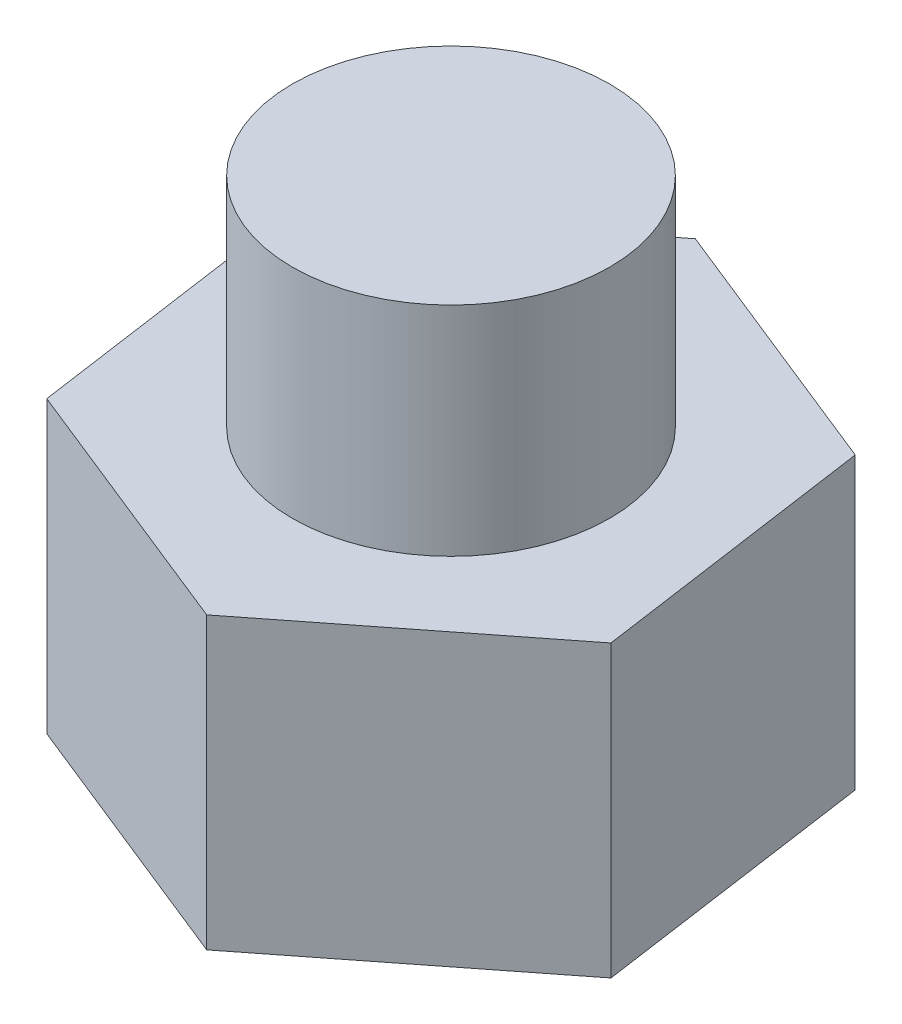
from build123d import *

# Parameters (mm, degrees)
EXTRUDE1_DEPTH     = 12.7
SKETCH2_R          = 5.55625
EXTRUDE2_DEPTH     = 7.62
SKETCH3_R          = 12.951509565
SKETCH3_R_2        = 5.08
CUT_EXTRUDE1_DEPTH = 2.54


with BuildPart() as part:
    # Sketch1 → Extrude1 (new body)
    with BuildSketch(Plane(origin=(0, 0, 0), x_dir=(1, 0, 0), z_dir=(0, 1, 0))):
        Polygon((1.425807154, -9.980650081), (9.356400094, -3.755539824), (7.930592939, 6.225110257), (-1.425807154, 9.980650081), (-9.356400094, 3.755539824), (-7.930592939, -6.225110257), align=None)
    extrude(amount=EXTRUDE1_DEPTH)

    # Sketch2 → Extrude2 (add)
    with BuildSketch(Plane(origin=(0, 12.7, 0), x_dir=(-1, 0, 0), z_dir=(0, 1, 0))):
        with Locations(Location((0, 0, 0), (0, 0, 270))):
            Circle(SKETCH2_R)
    extrude(amount=EXTRUDE2_DEPTH)

    # Sketch3 → Cut-Extrude1 (cut)
    with BuildSketch(Plane.XZ):
        Circle(SKETCH3_R)
        with Locations(Location((0, 0, 0), (0, 0, 270))):
            Circle(SKETCH3_R_2, mode=Mode.SUBTRACT)
    extrude(amount=-CUT_EXTRUDE1_DEPTH, mode=Mode.SUBTRACT)


solid = part.part
